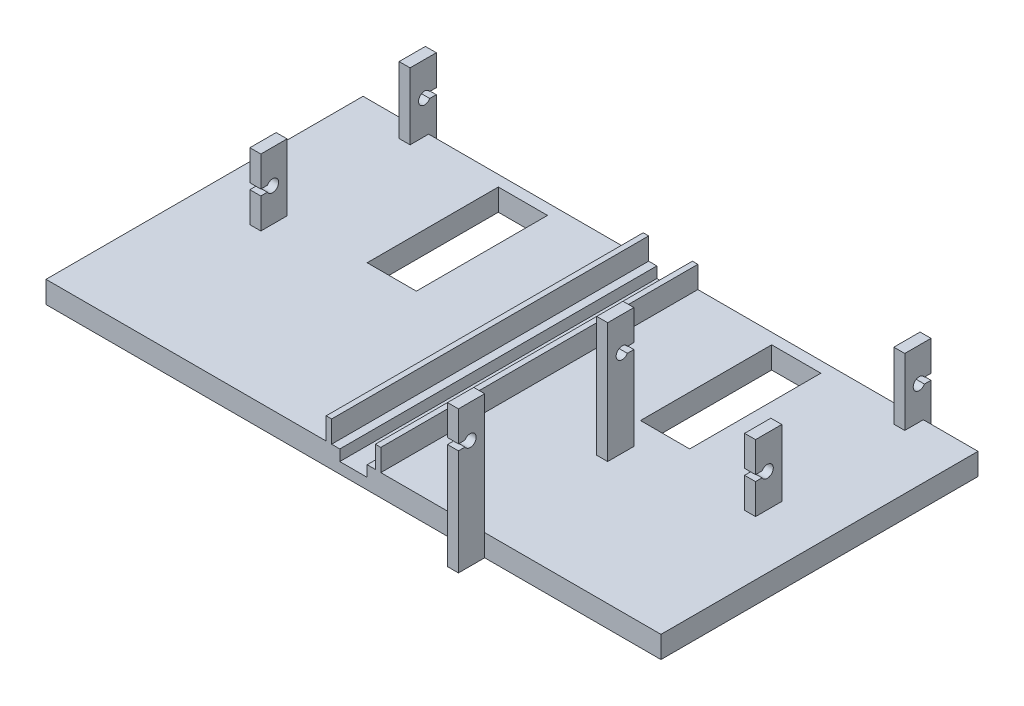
from build123d import *

# Parameters (mm, degrees)
SKETCH1_W            = 112.5
SKETCH1_H            = 41
BOSS_EXTRUDE1_DEPTH  = 4
SKETCH2_W            = 9
SKETCH2_H            = 11
CUT_EXTRUDE2_DEPTH   = 120.805049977
CUT_EXTRUDE4_DEPTH   = 9
CUT_EXTRUDE7_DEPTH   = 9
SKETCH17_W           = 2
SKETCH17_H           = 4
BOSS_EXTRUDE2_DEPTH  = 1.4
SKETCH16_W           = 2
SKETCH16_H           = 4.8
BOSS_EXTRUDE3_DEPTH  = 12.2
CUT_EXTRUDE8_DEPTH   = 100.5
SKETCH19_W           = 2
SKETCH19_H           = 4.8
BOSS_EXTRUDE4_DEPTH  = 12.2
MIRROR2_COPY_1_DEPTH = 100.5
SKETCH20_W           = 9
SKETCH20_H           = 13
CUT_EXTRUDE9_DEPTH   = 121.358173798
SKETCH21_W           = 112.5
SKETCH21_H           = 4
BOSS_EXTRUDE5_DEPTH  = 17
SKETCH25_W           = 2
SKETCH25_H           = 4
BOSS_EXTRUDE6_DEPTH  = 4.8
SKETCH24_W           = 2
SKETCH24_H           = 4.8
BOSS_EXTRUDE7_DEPTH  = 22
CUT_EXTRUDE10_DEPTH  = 2
SKETCH22_W           = 1
SKETCH22_H           = 58
BOSS_EXTRUDE8_DEPTH  = 4
SKETCH22_5_W         = 5
SKETCH22_5_H         = 58
CUT_EXTRUDE11_DEPTH  = 2


with BuildPart() as part:
    # Sketch1 → Boss-Extrude1 (new body)
    with BuildSketch(Plane(origin=(0, 0, 0), x_dir=(1, 0, 0), z_dir=(0, 1, 0))):
        with Locations((56.25, -20.5)):
            Rectangle(SKETCH1_W, SKETCH1_H)
    extrude(amount=BOSS_EXTRUDE1_DEPTH)

    # Sketch2 → Cut-Extrude2 (cut, through all)
    with BuildSketch(Plane(origin=(0, 0, 0), x_dir=(1, 0, 0), z_dir=(0, 1, 0))):
        with Locations((31.25, -20.5)):
            Rectangle(SKETCH2_W, SKETCH2_H)
        with Locations((81.25, -20.5)):
            Rectangle(SKETCH2_W, SKETCH2_H)
    extrude(amount=CUT_EXTRUDE2_DEPTH, mode=Mode.SUBTRACT)

    # Sketch9 → Cut-Extrude4 (cut)
    with BuildSketch(Plane(origin=(76.75, 0, 0), x_dir=(0, 0, -1), z_dir=(1, 0, 0))):
        Polygon((-37, 1.295779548), (-36.630569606, 0), (-31.431330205, 0), (-32.191604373, 2.666666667), align=None)
    extrude(amount=CUT_EXTRUDE4_DEPTH, mode=Mode.SUBTRACT)

    # Sketch14 → Cut-Extrude7 (cut)
    with BuildSketch(Plane(origin=(26.75, 0, 0), x_dir=(0, 0, -1), z_dir=(1, 0, 0))):
        Polygon((-37, 1.295779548), (-36.630569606, 0), (-31.431330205, 0), (-32.191604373, 2.666666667), align=None)
    extrude(amount=CUT_EXTRUDE7_DEPTH, mode=Mode.SUBTRACT)

    # Sketch17 → Boss-Extrude2 (add)
    with BuildSketch(Plane(origin=(0, 0, 0), x_dir=(-1, 0, 0), z_dir=(0, 0, -1))):
        with Locations((-11, 2)):
            Rectangle(SKETCH17_W, SKETCH17_H)
    boss_extrude2 = extrude(amount=BOSS_EXTRUDE2_DEPTH)

    # Sketch16 → Boss-Extrude3 (add)
    with BuildSketch(Plane(origin=(0, 4, 0), x_dir=(1, 0, 0), z_dir=(0, 1, 0))):
        with Locations((11, -1)):
            Rectangle(SKETCH16_W, SKETCH16_H)
    boss_extrude3 = extrude(amount=BOSS_EXTRUDE3_DEPTH)

    # Sketch18 → Cut-Extrude8 (cut)
    with BuildSketch(Plane.ZY):
        with BuildLine():
            ThreePointArc((1.85, 10.1), (1.03470095, 11.162518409), (-0.202627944, 10.65))
            Line((-0.202627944, 10.65), (0.75, 10.65))
            Line((0.75, 10.65), (0.75, 9.55))
            Line((0.75, 9.55), (-0.202627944, 9.55))
            ThreePointArc((-0.202627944, 9.55), (1.03470095, 9.037481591), (1.85, 10.1))
        make_face()
        with BuildLine():
            Line((0.75, 10.65), (-0.202627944, 10.65))
            ThreePointArc((-0.202627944, 10.65), (-0.35, 10.1), (-0.202627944, 9.55))
            Line((-0.202627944, 9.55), (0.75, 9.55))
            Line((0.75, 9.55), (0.75, 10.65))
        make_face()
        with BuildLine():
            ThreePointArc((1.85, 10.1), (1.03470095, 11.162518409), (-0.202627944, 10.65))
            Line((-0.202627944, 10.65), (0.75, 10.65))
            Line((0.75, 10.65), (0.75, 9.55))
            Line((0.75, 9.55), (-0.202627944, 9.55))
            ThreePointArc((-0.202627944, 9.55), (1.03470095, 9.037481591), (1.85, 10.1))
        make_face()
        with BuildLine():
            Line((0.75, 10.65), (-0.202627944, 10.65))
            ThreePointArc((-0.202627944, 10.65), (-0.35, 10.1), (-0.202627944, 9.55))
            Line((-0.202627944, 9.55), (0.75, 9.55))
            Line((0.75, 9.55), (0.75, 10.65))
        make_face()
        with BuildLine():
            Line((-0.202627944, 10.65), (-1.4, 10.65))
            Line((-1.4, 10.65), (-1.4, 9.55))
            Line((-1.4, 9.55), (-0.202627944, 9.55))
            ThreePointArc((-0.202627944, 9.55), (-0.35, 10.1), (-0.202627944, 10.65))
        make_face()
    cut_extrude8 = extrude(amount=-CUT_EXTRUDE8_DEPTH, mode=Mode.SUBTRACT)

    # Sketch19 → Boss-Extrude4 (add)
    with BuildSketch(Plane(origin=(0, 4, 0), x_dir=(1, 0, 0), z_dir=(0, 1, 0))):
        with Locations((11, -28.3)):
            Rectangle(SKETCH19_W, SKETCH19_H)
    boss_extrude4 = extrude(amount=BOSS_EXTRUDE4_DEPTH)

    # Mirror1: Cut-Extrude8 across plane
    add(cut_extrude8.mirror(Plane.XY.offset(14.65)), mode=Mode.SUBTRACT)

    # Mirror2: Boss-Extrude2, Boss-Extrude3, Cut-Extrude8, Boss-Extrude4 across plane
    add(boss_extrude2.mirror(Plane(origin=(56.25, 0, 0), x_dir=(0, 0, 1), z_dir=(1, 0, 0))))
    add(boss_extrude3.mirror(Plane(origin=(56.25, 0, 0), x_dir=(0, 0, 1), z_dir=(1, 0, 0))))
    add(cut_extrude8.mirror(Plane(origin=(56.25, 0, 0), x_dir=(0, 0, 1), z_dir=(1, 0, 0))), mode=Mode.SUBTRACT)
    add(boss_extrude4.mirror(Plane(origin=(56.25, 0, 0), x_dir=(0, 0, 1), z_dir=(1, 0, 0))))

    # Mirror2 copy 1 sketch → Mirror2 copy 1 (cut)
    with BuildSketch(Plane(origin=(112.5, 0, 29.3), x_dir=(0, 0, -1), z_dir=(1, 0, 0))):
        with BuildLine():
            ThreePointArc((1.85, 10.1), (1.03470095, 11.162518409), (-0.202627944, 10.65))
            Line((-0.202627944, 10.65), (0.75, 10.65))
            Line((0.75, 10.65), (0.75, 9.55))
            Line((0.75, 9.55), (-0.202627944, 9.55))
            ThreePointArc((-0.202627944, 9.55), (1.03470095, 9.037481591), (1.85, 10.1))
        make_face()
        with BuildLine():
            Line((0.75, 10.65), (-0.202627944, 10.65))
            ThreePointArc((-0.202627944, 10.65), (-0.35, 10.1), (-0.202627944, 9.55))
            Line((-0.202627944, 9.55), (0.75, 9.55))
            Line((0.75, 9.55), (0.75, 10.65))
        make_face()
        with BuildLine():
            ThreePointArc((1.85, 10.1), (1.03470095, 11.162518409), (-0.202627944, 10.65))
            Line((-0.202627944, 10.65), (0.75, 10.65))
            Line((0.75, 10.65), (0.75, 9.55))
            Line((0.75, 9.55), (-0.202627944, 9.55))
            ThreePointArc((-0.202627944, 9.55), (1.03470095, 9.037481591), (1.85, 10.1))
        make_face()
        with BuildLine():
            Line((0.75, 10.65), (-0.202627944, 10.65))
            ThreePointArc((-0.202627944, 10.65), (-0.35, 10.1), (-0.202627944, 9.55))
            Line((-0.202627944, 9.55), (0.75, 9.55))
            Line((0.75, 9.55), (0.75, 10.65))
        make_face()
        with BuildLine():
            Line((-0.202627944, 10.65), (-1.4, 10.65))
            Line((-1.4, 10.65), (-1.4, 9.55))
            Line((-1.4, 9.55), (-0.202627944, 9.55))
            ThreePointArc((-0.202627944, 9.55), (-0.35, 10.1), (-0.202627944, 10.65))
        make_face()
    extrude(amount=-MIRROR2_COPY_1_DEPTH, mode=Mode.SUBTRACT)

    # Sketch20 → Cut-Extrude9 (cut, through all)
    with BuildSketch(Plane(origin=(0, 4, 0), x_dir=(1, 0, 0), z_dir=(0, 1, 0))):
        with Locations((31.25, -8.5)):
            Rectangle(SKETCH20_W, SKETCH20_H)
        with Locations((81.25, -8.5)):
            Rectangle(SKETCH20_W, SKETCH20_H)
    extrude(amount=-CUT_EXTRUDE9_DEPTH, mode=Mode.SUBTRACT)

    # Sketch21 → Boss-Extrude5 (add)
    with BuildSketch(Plane.XY.offset(41)):
        with Locations((56.25, 2)):
            Rectangle(SKETCH21_W, SKETCH21_H)
    extrude(amount=BOSS_EXTRUDE5_DEPTH)

    # Sketch25 → Boss-Extrude6 (add)
    with BuildSketch(Plane.XY.offset(58)):
        with Locations((79.25, 2)):
            Rectangle(SKETCH25_W, SKETCH25_H)
    extrude(amount=BOSS_EXTRUDE6_DEPTH)

    # Sketch24 → Boss-Extrude7 (add)
    with BuildSketch(Plane(origin=(0, 4, 0), x_dir=(1, 0, 0), z_dir=(0, 1, 0))):
        with Locations((79.25, -60.4)):
            Rectangle(SKETCH24_W, SKETCH24_H)
        with Locations((79.25, -33.1)):
            Rectangle(SKETCH24_W, SKETCH24_H)
    extrude(amount=BOSS_EXTRUDE7_DEPTH)

    # Sketch26 → Cut-Extrude10 (cut)
    with BuildSketch(Plane(origin=(80.25, 0, 0), x_dir=(0, 0, -1), z_dir=(1, 0, 0))):
        with BuildLine():
            ThreePointArc((-59.55, 19.9), (-60.36529905, 20.962518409), (-61.602627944, 20.45))
            Line((-61.602627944, 20.45), (-60.65, 20.45))
            Line((-60.65, 20.45), (-60.65, 19.35))
            Line((-60.65, 19.35), (-61.602627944, 19.35))
            ThreePointArc((-61.602627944, 19.35), (-60.36529905, 18.837481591), (-59.55, 19.9))
        make_face()
        with BuildLine():
            Line((-60.65, 20.45), (-61.602627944, 20.45))
            ThreePointArc((-61.602627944, 20.45), (-61.75, 19.9), (-61.602627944, 19.35))
            Line((-61.602627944, 19.35), (-60.65, 19.35))
            Line((-60.65, 19.35), (-60.65, 20.45))
        make_face()
        with BuildLine():
            ThreePointArc((-59.55, 19.9), (-60.36529905, 20.962518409), (-61.602627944, 20.45))
            Line((-61.602627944, 20.45), (-60.65, 20.45))
            Line((-60.65, 20.45), (-60.65, 19.35))
            Line((-60.65, 19.35), (-61.602627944, 19.35))
            ThreePointArc((-61.602627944, 19.35), (-60.36529905, 18.837481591), (-59.55, 19.9))
        make_face()
        with BuildLine():
            Line((-60.65, 20.45), (-61.602627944, 20.45))
            ThreePointArc((-61.602627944, 20.45), (-61.75, 19.9), (-61.602627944, 19.35))
            Line((-61.602627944, 19.35), (-60.65, 19.35))
            Line((-60.65, 19.35), (-60.65, 20.45))
        make_face()
        with BuildLine():
            Line((-61.602627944, 20.45), (-62.8, 20.45))
            Line((-62.8, 20.45), (-62.8, 19.35))
            Line((-62.8, 19.35), (-61.602627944, 19.35))
            ThreePointArc((-61.602627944, 19.35), (-61.75, 19.9), (-61.602627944, 20.45))
        make_face()
    cut_extrude10 = extrude(amount=-CUT_EXTRUDE10_DEPTH, mode=Mode.SUBTRACT)

    # Mirror3: Cut-Extrude10 across plane
    add(cut_extrude10.mirror(Plane(origin=(0, 0, 46.75), x_dir=(1, 0, 0), z_dir=(0, 0, -1))), mode=Mode.SUBTRACT)

    # Sketch22 → Boss-Extrude8 (add)
    with BuildSketch(Plane(origin=(0, 4, 0), x_dir=(1, 0, 0), z_dir=(0, 1, 0))):
        with Locations((60.75, -29)):
            Rectangle(SKETCH22_W, SKETCH22_H)
        with Locations((51.75, -29)):
            Rectangle(SKETCH22_W, SKETCH22_H)
    extrude(amount=BOSS_EXTRUDE8_DEPTH)

    # Sketch22_5 → Cut-Extrude11 (cut)
    with BuildSketch(Plane(origin=(0, 4, 0), x_dir=(1, 0, 0), z_dir=(0, 1, 0))):
        with Locations((56.25, -29)):
            Rectangle(SKETCH22_5_W, SKETCH22_5_H)
    extrude(amount=-CUT_EXTRUDE11_DEPTH, mode=Mode.SUBTRACT)


solid = part.part
